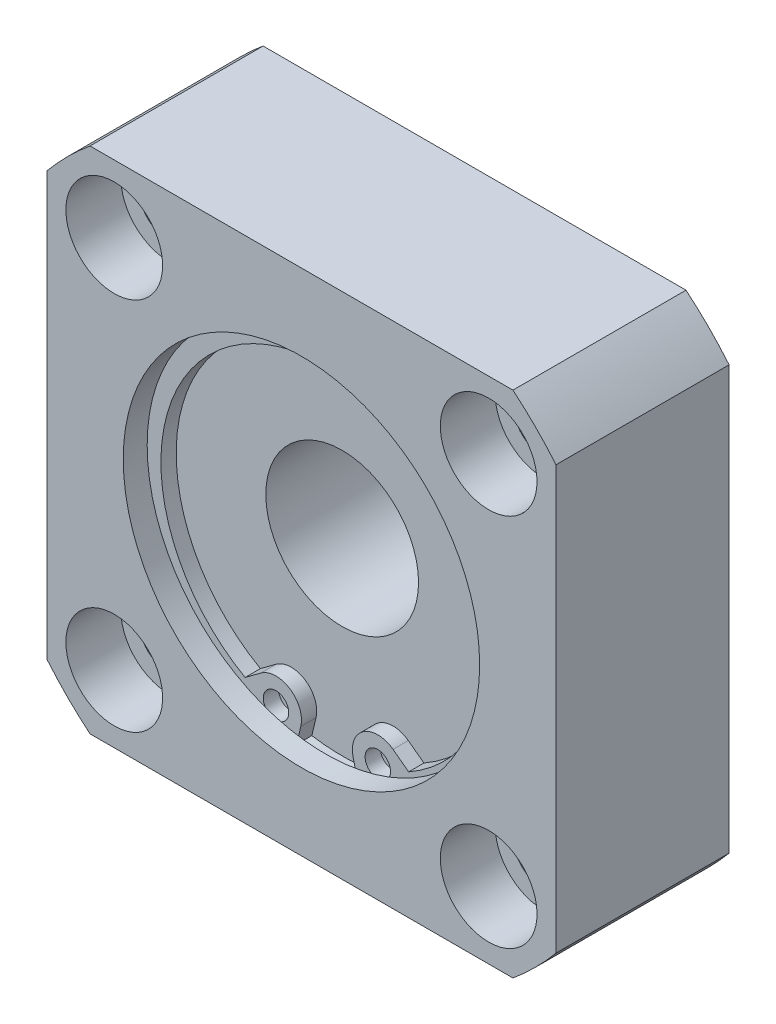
ISO-10303-21;
HEADER;
FILE_DESCRIPTION(('STEP AP214'),'2;1');
FILE_NAME('part.step','',(''),(''),'','','');
FILE_SCHEMA(('AUTOMOTIVE_DESIGN { 1 0 10303 214 1 1 1 1 }'));
ENDSEC;
DATA;
#1=APPLICATION_CONTEXT('core data for automotive mechanical design processes');
#2=APPLICATION_PROTOCOL_DEFINITION('international standard','automotive_design',2000,#1);
#3=PRODUCT_CONTEXT('',#1,'mechanical');
#4=PRODUCT('Part','Part','',(#3));
#5=PRODUCT_RELATED_PRODUCT_CATEGORY('part','',(#4));
#6=PRODUCT_DEFINITION_FORMATION('','',#4);
#7=PRODUCT_DEFINITION_CONTEXT('part definition',#1,'design');
#8=PRODUCT_DEFINITION('design','',#6,#7);
#9=PRODUCT_DEFINITION_SHAPE('','',#8);
#10=(LENGTH_UNIT() NAMED_UNIT(*) SI_UNIT(.MILLI.,.METRE.));
#11=(NAMED_UNIT(*) PLANE_ANGLE_UNIT() SI_UNIT($,.RADIAN.));
#12=(NAMED_UNIT(*) SI_UNIT($,.STERADIAN.) SOLID_ANGLE_UNIT());
#13=UNCERTAINTY_MEASURE_WITH_UNIT(LENGTH_MEASURE(1.E-05),#10,'distance_accuracy_value','');
#14=(GEOMETRIC_REPRESENTATION_CONTEXT(3) GLOBAL_UNCERTAINTY_ASSIGNED_CONTEXT((#13)) GLOBAL_UNIT_ASSIGNED_CONTEXT((#10,
#11,#12)) REPRESENTATION_CONTEXT('',''));
#15=CARTESIAN_POINT('',(0.,0.,0.));
#16=DIRECTION('',(0.,0.,1.));
#17=DIRECTION('',(1.,0.,0.));
#18=AXIS2_PLACEMENT_3D('',#15,#16,#17);
#19=CARTESIAN_POINT('',(18.3847763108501,18.3847763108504,0.));
#20=DIRECTION('',(0.,0.,1.));
#21=DIRECTION('',(1.,0.,0.));
#22=AXIS2_PLACEMENT_3D('',#19,#20,#21);
#23=CYLINDRICAL_SURFACE('',#22,3.);
#24=CARTESIAN_POINT('',(18.3847763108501,18.3847763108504,0.));
#25=DIRECTION('',(0.,0.,1.));
#26=DIRECTION('',(1.,0.,0.));
#27=AXIS2_PLACEMENT_3D('',#24,#25,#26);
#28=CIRCLE('',#27,3.);
#29=CARTESIAN_POINT('',(21.3847763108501,18.3847763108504,0.));
#30=VERTEX_POINT('',#29);
#31=EDGE_CURVE('E272',#30,#30,#28,.T.);
#32=ORIENTED_EDGE('',*,*,#31,.F.);
#33=EDGE_LOOP('',(#32));
#34=FACE_BOUND('',#33,.T.);
#35=CARTESIAN_POINT('',(18.3847763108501,18.3847763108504,11.6));
#36=DIRECTION('',(0.,0.,1.));
#37=DIRECTION('',(1.,0.,0.));
#38=AXIS2_PLACEMENT_3D('',#35,#36,#37);
#39=CIRCLE('',#38,3.);
#40=CARTESIAN_POINT('',(21.3847763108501,18.3847763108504,11.6));
#41=VERTEX_POINT('',#40);
#42=EDGE_CURVE('E269',#41,#41,#39,.F.);
#43=ORIENTED_EDGE('',*,*,#42,.F.);
#44=EDGE_LOOP('',(#43));
#45=FACE_BOUND('',#44,.T.);
#46=ADVANCED_FACE('F14',(#34,#45),#23,.F.);
#47=CARTESIAN_POINT('',(18.3847763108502,-18.3847763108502,0.));
#48=DIRECTION('',(0.,0.,1.));
#49=DIRECTION('',(1.,0.,0.));
#50=AXIS2_PLACEMENT_3D('',#47,#48,#49);
#51=CYLINDRICAL_SURFACE('',#50,3.);
#52=CARTESIAN_POINT('',(18.3847763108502,-18.3847763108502,0.));
#53=DIRECTION('',(0.,0.,1.));
#54=DIRECTION('',(0.,-1.,0.));
#55=AXIS2_PLACEMENT_3D('',#52,#53,#54);
#56=CIRCLE('',#55,3.);
#57=CARTESIAN_POINT('',(18.3847763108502,-21.3847763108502,0.));
#58=VERTEX_POINT('',#57);
#59=EDGE_CURVE('E341',#58,#58,#56,.T.);
#60=ORIENTED_EDGE('',*,*,#59,.F.);
#61=EDGE_LOOP('',(#60));
#62=FACE_BOUND('',#61,.T.);
#63=CARTESIAN_POINT('',(18.3847763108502,-18.3847763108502,11.6));
#64=DIRECTION('',(0.,0.,1.));
#65=DIRECTION('',(1.,0.,0.));
#66=AXIS2_PLACEMENT_3D('',#63,#64,#65);
#67=CIRCLE('',#66,3.);
#68=CARTESIAN_POINT('',(21.3847763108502,-18.3847763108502,11.6));
#69=VERTEX_POINT('',#68);
#70=EDGE_CURVE('E264',#69,#69,#67,.F.);
#71=ORIENTED_EDGE('',*,*,#70,.F.);
#72=EDGE_LOOP('',(#71));
#73=FACE_BOUND('',#72,.T.);
#74=ADVANCED_FACE('F529',(#62,#73),#51,.F.);
#75=CARTESIAN_POINT('',(-18.3847763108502,-18.3847763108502,0.));
#76=DIRECTION('',(0.,0.,1.));
#77=DIRECTION('',(1.,0.,0.));
#78=AXIS2_PLACEMENT_3D('',#75,#76,#77);
#79=CYLINDRICAL_SURFACE('',#78,3.);
#80=CARTESIAN_POINT('',(-18.3847763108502,-18.3847763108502,0.));
#81=DIRECTION('',(0.,0.,1.));
#82=DIRECTION('',(-1.,0.,0.));
#83=AXIS2_PLACEMENT_3D('',#80,#81,#82);
#84=CIRCLE('',#83,3.);
#85=CARTESIAN_POINT('',(-21.3847763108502,-18.3847763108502,0.));
#86=VERTEX_POINT('',#85);
#87=EDGE_CURVE('E344',#86,#86,#84,.T.);
#88=ORIENTED_EDGE('',*,*,#87,.F.);
#89=EDGE_LOOP('',(#88));
#90=FACE_BOUND('',#89,.T.);
#91=CARTESIAN_POINT('',(-18.3847763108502,-18.3847763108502,11.6));
#92=DIRECTION('',(0.,0.,1.));
#93=DIRECTION('',(1.,0.,0.));
#94=AXIS2_PLACEMENT_3D('',#91,#92,#93);
#95=CIRCLE('',#94,3.);
#96=CARTESIAN_POINT('',(-15.3847763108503,-18.3847763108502,11.6));
#97=VERTEX_POINT('',#96);
#98=EDGE_CURVE('E259',#97,#97,#95,.F.);
#99=ORIENTED_EDGE('',*,*,#98,.F.);
#100=EDGE_LOOP('',(#99));
#101=FACE_BOUND('',#100,.T.);
#102=ADVANCED_FACE('F538',(#90,#101),#79,.F.);
#103=CARTESIAN_POINT('',(-18.3847763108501,18.3847763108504,0.));
#104=DIRECTION('',(0.,0.,1.));
#105=DIRECTION('',(1.,0.,0.));
#106=AXIS2_PLACEMENT_3D('',#103,#104,#105);
#107=CYLINDRICAL_SURFACE('',#106,3.);
#108=CARTESIAN_POINT('',(-18.3847763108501,18.3847763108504,0.));
#109=DIRECTION('',(0.,0.,1.));
#110=DIRECTION('',(0.,1.,0.));
#111=AXIS2_PLACEMENT_3D('',#108,#109,#110);
#112=CIRCLE('',#111,3.);
#113=CARTESIAN_POINT('',(-18.3847763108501,21.3847763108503,0.));
#114=VERTEX_POINT('',#113);
#115=EDGE_CURVE('E267',#114,#114,#112,.T.);
#116=ORIENTED_EDGE('',*,*,#115,.F.);
#117=EDGE_LOOP('',(#116));
#118=FACE_BOUND('',#117,.T.);
#119=CARTESIAN_POINT('',(-18.3847763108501,18.3847763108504,11.6));
#120=DIRECTION('',(0.,0.,1.));
#121=DIRECTION('',(1.,0.,0.));
#122=AXIS2_PLACEMENT_3D('',#119,#120,#121);
#123=CIRCLE('',#122,3.);
#124=CARTESIAN_POINT('',(-15.3847763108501,18.3847763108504,11.6));
#125=VERTEX_POINT('',#124);
#126=EDGE_CURVE('E254',#125,#125,#123,.F.);
#127=ORIENTED_EDGE('',*,*,#126,.F.);
#128=EDGE_LOOP('',(#127));
#129=FACE_BOUND('',#128,.T.);
#130=ADVANCED_FACE('F547',(#118,#129),#107,.F.);
#131=CARTESIAN_POINT('',(18.3847763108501,18.3847763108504,11.6));
#132=DIRECTION('',(0.,0.,1.));
#133=DIRECTION('',(1.,0.,0.));
#134=AXIS2_PLACEMENT_3D('',#131,#132,#133);
#135=PLANE('',#134);
#136=CARTESIAN_POINT('',(18.3847763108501,18.3847763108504,11.6));
#137=DIRECTION('',(0.,0.,1.));
#138=DIRECTION('',(1.,0.,0.));
#139=AXIS2_PLACEMENT_3D('',#136,#137,#138);
#140=CIRCLE('',#139,4.75);
#141=CARTESIAN_POINT('',(23.1347763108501,18.3847763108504,11.6));
#142=VERTEX_POINT('',#141);
#143=EDGE_CURVE('E273',#142,#142,#140,.T.);
#144=ORIENTED_EDGE('',*,*,#143,.T.);
#145=EDGE_LOOP('',(#144));
#146=FACE_BOUND('',#145,.T.);
#147=ORIENTED_EDGE('',*,*,#42,.T.);
#148=EDGE_LOOP('',(#147));
#149=FACE_BOUND('',#148,.T.);
#150=ADVANCED_FACE('F556',(#146,#149),#135,.T.);
#151=CARTESIAN_POINT('',(18.3847763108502,-18.3847763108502,11.6));
#152=DIRECTION('',(0.,0.,1.));
#153=DIRECTION('',(0.,-1.,0.));
#154=AXIS2_PLACEMENT_3D('',#151,#152,#153);
#155=PLANE('',#154);
#156=CARTESIAN_POINT('',(18.3847763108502,-18.3847763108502,11.6));
#157=DIRECTION('',(0.,0.,1.));
#158=DIRECTION('',(0.,-1.,0.));
#159=AXIS2_PLACEMENT_3D('',#156,#157,#158);
#160=CIRCLE('',#159,4.75);
#161=CARTESIAN_POINT('',(18.3847763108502,-23.1347763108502,11.6));
#162=VERTEX_POINT('',#161);
#163=EDGE_CURVE('E268',#162,#162,#160,.T.);
#164=ORIENTED_EDGE('',*,*,#163,.T.);
#165=EDGE_LOOP('',(#164));
#166=FACE_BOUND('',#165,.T.);
#167=ORIENTED_EDGE('',*,*,#70,.T.);
#168=EDGE_LOOP('',(#167));
#169=FACE_BOUND('',#168,.T.);
#170=ADVANCED_FACE('F565',(#166,#169),#155,.T.);
#171=CARTESIAN_POINT('',(-18.3847763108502,-18.3847763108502,11.6));
#172=DIRECTION('',(0.,0.,1.));
#173=DIRECTION('',(-1.,0.,0.));
#174=AXIS2_PLACEMENT_3D('',#171,#172,#173);
#175=PLANE('',#174);
#176=CARTESIAN_POINT('',(-18.3847763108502,-18.3847763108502,11.6));
#177=DIRECTION('',(0.,0.,1.));
#178=DIRECTION('',(-1.,0.,0.));
#179=AXIS2_PLACEMENT_3D('',#176,#177,#178);
#180=CIRCLE('',#179,4.75);
#181=CARTESIAN_POINT('',(-23.1347763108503,-18.3847763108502,11.6));
#182=VERTEX_POINT('',#181);
#183=EDGE_CURVE('E263',#182,#182,#180,.T.);
#184=ORIENTED_EDGE('',*,*,#183,.T.);
#185=EDGE_LOOP('',(#184));
#186=FACE_BOUND('',#185,.T.);
#187=ORIENTED_EDGE('',*,*,#98,.T.);
#188=EDGE_LOOP('',(#187));
#189=FACE_BOUND('',#188,.T.);
#190=ADVANCED_FACE('F574',(#186,#189),#175,.T.);
#191=CARTESIAN_POINT('',(-18.3847763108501,18.3847763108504,11.6));
#192=DIRECTION('',(0.,0.,1.));
#193=DIRECTION('',(0.,1.,0.));
#194=AXIS2_PLACEMENT_3D('',#191,#192,#193);
#195=PLANE('',#194);
#196=CARTESIAN_POINT('',(-18.3847763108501,18.3847763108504,11.6));
#197=DIRECTION('',(0.,0.,1.));
#198=DIRECTION('',(0.,1.,0.));
#199=AXIS2_PLACEMENT_3D('',#196,#197,#198);
#200=CIRCLE('',#199,4.75);
#201=CARTESIAN_POINT('',(-18.3847763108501,23.1347763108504,11.6));
#202=VERTEX_POINT('',#201);
#203=EDGE_CURVE('E258',#202,#202,#200,.T.);
#204=ORIENTED_EDGE('',*,*,#203,.T.);
#205=EDGE_LOOP('',(#204));
#206=FACE_BOUND('',#205,.T.);
#207=ORIENTED_EDGE('',*,*,#126,.T.);
#208=EDGE_LOOP('',(#207));
#209=FACE_BOUND('',#208,.T.);
#210=ADVANCED_FACE('F583',(#206,#209),#195,.T.);
#211=CARTESIAN_POINT('',(0.,0.,0.));
#212=DIRECTION('',(0.,0.,-1.));
#213=DIRECTION('',(-1.,0.,0.));
#214=AXIS2_PLACEMENT_3D('',#211,#212,#213);
#215=PLANE('',#214);
#216=CARTESIAN_POINT('',(0.,0.,0.));
#217=DIRECTION('',(0.,0.,-1.));
#218=DIRECTION('',(-1.,0.,0.));
#219=AXIS2_PLACEMENT_3D('',#216,#217,#218);
#220=CIRCLE('',#219,14.5);
#221=CARTESIAN_POINT('',(-14.5,0.,0.));
#222=VERTEX_POINT('',#221);
#223=EDGE_CURVE('E243',#222,#222,#220,.T.);
#224=ORIENTED_EDGE('',*,*,#223,.F.);
#225=EDGE_LOOP('',(#224));
#226=FACE_BOUND('',#225,.T.);
#227=ORIENTED_EDGE('',*,*,#115,.T.);
#228=EDGE_LOOP('',(#227));
#229=FACE_BOUND('',#228,.T.);
#230=ORIENTED_EDGE('',*,*,#87,.T.);
#231=EDGE_LOOP('',(#230));
#232=FACE_BOUND('',#231,.T.);
#233=ORIENTED_EDGE('',*,*,#59,.T.);
#234=EDGE_LOOP('',(#233));
#235=FACE_BOUND('',#234,.T.);
#236=ORIENTED_EDGE('',*,*,#31,.T.);
#237=EDGE_LOOP('',(#236));
#238=FACE_BOUND('',#237,.T.);
#239=CARTESIAN_POINT('',(0.,0.,0.));
#240=DIRECTION('',(0.,0.,-1.));
#241=DIRECTION('',(-1.,0.,0.));
#242=AXIS2_PLACEMENT_3D('',#239,#240,#241);
#243=CIRCLE('',#242,32.5);
#244=CARTESIAN_POINT('',(25.,-20.7665596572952,0.));
#245=VERTEX_POINT('',#244);
#246=CARTESIAN_POINT('',(20.7665596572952,-25.,0.));
#247=VERTEX_POINT('',#246);
#248=EDGE_CURVE('E332',#245,#247,#243,.T.);
#249=ORIENTED_EDGE('',*,*,#248,.T.);
#250=DIRECTION('',(1.,0.,0.));
#251=VECTOR('',#250,1.);
#252=CARTESIAN_POINT('',(-20.7665596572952,-25.,0.));
#253=LINE('',#252,#251);
#254=CARTESIAN_POINT('',(-20.7665596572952,-25.,0.));
#255=VERTEX_POINT('',#254);
#256=EDGE_CURVE('E329',#255,#247,#253,.T.);
#257=ORIENTED_EDGE('',*,*,#256,.F.);
#258=CARTESIAN_POINT('',(0.,0.,0.));
#259=DIRECTION('',(0.,0.,1.));
#260=DIRECTION('',(1.,0.,0.));
#261=AXIS2_PLACEMENT_3D('',#258,#259,#260);
#262=CIRCLE('',#261,32.5);
#263=CARTESIAN_POINT('',(-25.,-20.7665596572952,0.));
#264=VERTEX_POINT('',#263);
#265=EDGE_CURVE('E326',#264,#255,#262,.T.);
#266=ORIENTED_EDGE('',*,*,#265,.F.);
#267=DIRECTION('',(0.,1.,0.));
#268=VECTOR('',#267,1.);
#269=CARTESIAN_POINT('',(-25.,-20.7665596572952,0.));
#270=LINE('',#269,#268);
#271=CARTESIAN_POINT('',(-25.,20.7665596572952,0.));
#272=VERTEX_POINT('',#271);
#273=EDGE_CURVE('E323',#264,#272,#270,.T.);
#274=ORIENTED_EDGE('',*,*,#273,.T.);
#275=CARTESIAN_POINT('',(0.,0.,0.));
#276=DIRECTION('',(0.,0.,-1.));
#277=DIRECTION('',(-1.,0.,0.));
#278=AXIS2_PLACEMENT_3D('',#275,#276,#277);
#279=CIRCLE('',#278,32.5);
#280=CARTESIAN_POINT('',(-20.7665596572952,25.,0.));
#281=VERTEX_POINT('',#280);
#282=EDGE_CURVE('E320',#272,#281,#279,.T.);
#283=ORIENTED_EDGE('',*,*,#282,.T.);
#284=DIRECTION('',(1.,0.,0.));
#285=VECTOR('',#284,1.);
#286=CARTESIAN_POINT('',(-20.7665596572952,25.,0.));
#287=LINE('',#286,#285);
#288=CARTESIAN_POINT('',(20.7665596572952,25.,0.));
#289=VERTEX_POINT('',#288);
#290=EDGE_CURVE('E317',#281,#289,#287,.T.);
#291=ORIENTED_EDGE('',*,*,#290,.T.);
#292=CARTESIAN_POINT('',(0.,0.,0.));
#293=DIRECTION('',(0.,0.,1.));
#294=DIRECTION('',(1.,0.,0.));
#295=AXIS2_PLACEMENT_3D('',#292,#293,#294);
#296=CIRCLE('',#295,32.5);
#297=CARTESIAN_POINT('',(25.,20.7665596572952,0.));
#298=VERTEX_POINT('',#297);
#299=EDGE_CURVE('E314',#298,#289,#296,.T.);
#300=ORIENTED_EDGE('',*,*,#299,.F.);
#301=DIRECTION('',(0.,1.,0.));
#302=VECTOR('',#301,1.);
#303=CARTESIAN_POINT('',(25.,-20.7665596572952,0.));
#304=LINE('',#303,#302);
#305=EDGE_CURVE('E311',#245,#298,#304,.T.);
#306=ORIENTED_EDGE('',*,*,#305,.F.);
#307=EDGE_LOOP('',(#249,#257,#266,#274,#283,#291,#300,#306));
#308=FACE_BOUND('',#307,.T.);
#309=ADVANCED_FACE('F431',(#226,#229,#232,#235,#238,#308),#215,.T.);
#310=CARTESIAN_POINT('',(-20.7665596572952,-25.,17.));
#311=DIRECTION('',(0.,1.,0.));
#312=DIRECTION('',(0.,0.,1.));
#313=AXIS2_PLACEMENT_3D('',#310,#311,#312);
#314=PLANE('',#313);
#315=DIRECTION('',(1.,0.,0.));
#316=VECTOR('',#315,1.);
#317=CARTESIAN_POINT('',(-20.7665596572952,-25.,17.));
#318=LINE('',#317,#316);
#319=CARTESIAN_POINT('',(-20.7665596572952,-25.,17.));
#320=VERTEX_POINT('',#319);
#321=CARTESIAN_POINT('',(20.7665596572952,-25.,17.));
#322=VERTEX_POINT('',#321);
#323=EDGE_CURVE('E306',#320,#322,#318,.T.);
#324=ORIENTED_EDGE('',*,*,#323,.F.);
#325=DIRECTION('',(0.,0.,-1.));
#326=VECTOR('',#325,1.);
#327=CARTESIAN_POINT('',(-20.7665596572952,-25.,17.));
#328=LINE('',#327,#326);
#329=EDGE_CURVE('E285',#320,#255,#328,.T.);
#330=ORIENTED_EDGE('',*,*,#329,.T.);
#331=ORIENTED_EDGE('',*,*,#256,.T.);
#332=DIRECTION('',(0.,0.,-1.));
#333=VECTOR('',#332,1.);
#334=CARTESIAN_POINT('',(20.7665596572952,-25.,17.));
#335=LINE('',#334,#333);
#336=EDGE_CURVE('E74',#322,#247,#335,.T.);
#337=ORIENTED_EDGE('',*,*,#336,.F.);
#338=EDGE_LOOP('',(#324,#330,#331,#337));
#339=FACE_BOUND('',#338,.T.);
#340=ADVANCED_FACE('F429',(#339),#314,.F.);
#341=CARTESIAN_POINT('',(0.,0.,17.));
#342=DIRECTION('',(0.,0.,-1.));
#343=DIRECTION('',(-1.,0.,0.));
#344=AXIS2_PLACEMENT_3D('',#341,#342,#343);
#345=CYLINDRICAL_SURFACE('',#344,32.5);
#346=ORIENTED_EDGE('',*,*,#329,.F.);
#347=CARTESIAN_POINT('',(0.,0.,17.));
#348=DIRECTION('',(0.,0.,1.));
#349=DIRECTION('',(1.,0.,0.));
#350=AXIS2_PLACEMENT_3D('',#347,#348,#349);
#351=CIRCLE('',#350,32.5);
#352=CARTESIAN_POINT('',(-25.,-20.7665596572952,17.));
#353=VERTEX_POINT('',#352);
#354=EDGE_CURVE('E303',#353,#320,#351,.T.);
#355=ORIENTED_EDGE('',*,*,#354,.F.);
#356=DIRECTION('',(0.,0.,-1.));
#357=VECTOR('',#356,1.);
#358=CARTESIAN_POINT('',(-25.,-20.7665596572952,17.));
#359=LINE('',#358,#357);
#360=EDGE_CURVE('E283',#353,#264,#359,.T.);
#361=ORIENTED_EDGE('',*,*,#360,.T.);
#362=ORIENTED_EDGE('',*,*,#265,.T.);
#363=EDGE_LOOP('',(#346,#355,#361,#362));
#364=FACE_BOUND('',#363,.T.);
#365=ADVANCED_FACE('F425',(#364),#345,.T.);
#366=CARTESIAN_POINT('',(-25.,-20.7665596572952,17.));
#367=DIRECTION('',(-1.,0.,0.));
#368=DIRECTION('',(0.,0.,1.));
#369=AXIS2_PLACEMENT_3D('',#366,#367,#368);
#370=PLANE('',#369);
#371=ORIENTED_EDGE('',*,*,#360,.F.);
#372=DIRECTION('',(0.,1.,0.));
#373=VECTOR('',#372,1.);
#374=CARTESIAN_POINT('',(-25.,-20.7665596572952,17.));
#375=LINE('',#374,#373);
#376=CARTESIAN_POINT('',(-25.,20.7665596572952,17.));
#377=VERTEX_POINT('',#376);
#378=EDGE_CURVE('E300',#353,#377,#375,.T.);
#379=ORIENTED_EDGE('',*,*,#378,.T.);
#380=DIRECTION('',(0.,0.,-1.));
#381=VECTOR('',#380,1.);
#382=CARTESIAN_POINT('',(-25.,20.7665596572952,17.));
#383=LINE('',#382,#381);
#384=EDGE_CURVE('E281',#377,#272,#383,.T.);
#385=ORIENTED_EDGE('',*,*,#384,.T.);
#386=ORIENTED_EDGE('',*,*,#273,.F.);
#387=EDGE_LOOP('',(#371,#379,#385,#386));
#388=FACE_BOUND('',#387,.T.);
#389=ADVANCED_FACE('F422',(#388),#370,.T.);
#390=CARTESIAN_POINT('',(0.,0.,17.));
#391=DIRECTION('',(0.,0.,-1.));
#392=DIRECTION('',(-1.,0.,0.));
#393=AXIS2_PLACEMENT_3D('',#390,#391,#392);
#394=CYLINDRICAL_SURFACE('',#393,32.5);
#395=ORIENTED_EDGE('',*,*,#384,.F.);
#396=CARTESIAN_POINT('',(0.,0.,17.));
#397=DIRECTION('',(0.,0.,-1.));
#398=DIRECTION('',(-1.,0.,0.));
#399=AXIS2_PLACEMENT_3D('',#396,#397,#398);
#400=CIRCLE('',#399,32.5);
#401=CARTESIAN_POINT('',(-20.7665596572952,25.,17.));
#402=VERTEX_POINT('',#401);
#403=EDGE_CURVE('E297',#377,#402,#400,.T.);
#404=ORIENTED_EDGE('',*,*,#403,.T.);
#405=DIRECTION('',(0.,0.,-1.));
#406=VECTOR('',#405,1.);
#407=CARTESIAN_POINT('',(-20.7665596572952,25.,17.));
#408=LINE('',#407,#406);
#409=EDGE_CURVE('E279',#402,#281,#408,.T.);
#410=ORIENTED_EDGE('',*,*,#409,.T.);
#411=ORIENTED_EDGE('',*,*,#282,.F.);
#412=EDGE_LOOP('',(#395,#404,#410,#411));
#413=FACE_BOUND('',#412,.T.);
#414=ADVANCED_FACE('F419',(#413),#394,.T.);
#415=CARTESIAN_POINT('',(-20.7665596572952,25.,17.));
#416=DIRECTION('',(0.,1.,0.));
#417=DIRECTION('',(0.,0.,1.));
#418=AXIS2_PLACEMENT_3D('',#415,#416,#417);
#419=PLANE('',#418);
#420=ORIENTED_EDGE('',*,*,#409,.F.);
#421=DIRECTION('',(1.,0.,0.));
#422=VECTOR('',#421,1.);
#423=CARTESIAN_POINT('',(-20.7665596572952,25.,17.));
#424=LINE('',#423,#422);
#425=CARTESIAN_POINT('',(20.7665596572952,25.,17.));
#426=VERTEX_POINT('',#425);
#427=EDGE_CURVE('E294',#402,#426,#424,.T.);
#428=ORIENTED_EDGE('',*,*,#427,.T.);
#429=DIRECTION('',(0.,0.,-1.));
#430=VECTOR('',#429,1.);
#431=CARTESIAN_POINT('',(20.7665596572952,25.,17.));
#432=LINE('',#431,#430);
#433=EDGE_CURVE('E277',#426,#289,#432,.T.);
#434=ORIENTED_EDGE('',*,*,#433,.T.);
#435=ORIENTED_EDGE('',*,*,#290,.F.);
#436=EDGE_LOOP('',(#420,#428,#434,#435));
#437=FACE_BOUND('',#436,.T.);
#438=ADVANCED_FACE('F415',(#437),#419,.T.);
#439=CARTESIAN_POINT('',(0.,0.,17.));
#440=DIRECTION('',(0.,0.,-1.));
#441=DIRECTION('',(-1.,0.,0.));
#442=AXIS2_PLACEMENT_3D('',#439,#440,#441);
#443=CYLINDRICAL_SURFACE('',#442,32.5);
#444=ORIENTED_EDGE('',*,*,#433,.F.);
#445=CARTESIAN_POINT('',(0.,0.,17.));
#446=DIRECTION('',(0.,0.,1.));
#447=DIRECTION('',(1.,0.,0.));
#448=AXIS2_PLACEMENT_3D('',#445,#446,#447);
#449=CIRCLE('',#448,32.5);
#450=CARTESIAN_POINT('',(25.,20.7665596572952,17.));
#451=VERTEX_POINT('',#450);
#452=EDGE_CURVE('E291',#451,#426,#449,.T.);
#453=ORIENTED_EDGE('',*,*,#452,.F.);
#454=DIRECTION('',(0.,0.,-1.));
#455=VECTOR('',#454,1.);
#456=CARTESIAN_POINT('',(25.,20.7665596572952,17.));
#457=LINE('',#456,#455);
#458=EDGE_CURVE('E275',#451,#298,#457,.T.);
#459=ORIENTED_EDGE('',*,*,#458,.T.);
#460=ORIENTED_EDGE('',*,*,#299,.T.);
#461=EDGE_LOOP('',(#444,#453,#459,#460));
#462=FACE_BOUND('',#461,.T.);
#463=ADVANCED_FACE('F410',(#462),#443,.T.);
#464=CARTESIAN_POINT('',(25.,-20.7665596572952,17.));
#465=DIRECTION('',(-1.,0.,0.));
#466=DIRECTION('',(0.,0.,1.));
#467=AXIS2_PLACEMENT_3D('',#464,#465,#466);
#468=PLANE('',#467);
#469=ORIENTED_EDGE('',*,*,#458,.F.);
#470=DIRECTION('',(0.,1.,0.));
#471=VECTOR('',#470,1.);
#472=CARTESIAN_POINT('',(25.,-20.7665596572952,17.));
#473=LINE('',#472,#471);
#474=CARTESIAN_POINT('',(25.,-20.7665596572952,17.));
#475=VERTEX_POINT('',#474);
#476=EDGE_CURVE('E288',#475,#451,#473,.T.);
#477=ORIENTED_EDGE('',*,*,#476,.F.);
#478=DIRECTION('',(0.,0.,-1.));
#479=VECTOR('',#478,1.);
#480=CARTESIAN_POINT('',(25.,-20.7665596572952,17.));
#481=LINE('',#480,#479);
#482=EDGE_CURVE('E239',#475,#245,#481,.T.);
#483=ORIENTED_EDGE('',*,*,#482,.T.);
#484=ORIENTED_EDGE('',*,*,#305,.T.);
#485=EDGE_LOOP('',(#469,#477,#483,#484));
#486=FACE_BOUND('',#485,.T.);
#487=ADVANCED_FACE('F405',(#486),#468,.F.);
#488=CARTESIAN_POINT('',(0.,0.,17.));
#489=DIRECTION('',(0.,0.,-1.));
#490=DIRECTION('',(-1.,0.,0.));
#491=AXIS2_PLACEMENT_3D('',#488,#489,#490);
#492=CYLINDRICAL_SURFACE('',#491,32.5);
#493=ORIENTED_EDGE('',*,*,#482,.F.);
#494=CARTESIAN_POINT('',(0.,0.,17.));
#495=DIRECTION('',(0.,0.,-1.));
#496=DIRECTION('',(-1.,0.,0.));
#497=AXIS2_PLACEMENT_3D('',#494,#495,#496);
#498=CIRCLE('',#497,32.5);
#499=EDGE_CURVE('E309',#475,#322,#498,.T.);
#500=ORIENTED_EDGE('',*,*,#499,.T.);
#501=ORIENTED_EDGE('',*,*,#336,.T.);
#502=ORIENTED_EDGE('',*,*,#248,.F.);
#503=EDGE_LOOP('',(#493,#500,#501,#502));
#504=FACE_BOUND('',#503,.T.);
#505=ADVANCED_FACE('F432',(#504),#492,.T.);
#506=CARTESIAN_POINT('',(18.3847763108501,18.3847763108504,11.6));
#507=DIRECTION('',(0.,0.,1.));
#508=DIRECTION('',(1.,0.,0.));
#509=AXIS2_PLACEMENT_3D('',#506,#507,#508);
#510=CYLINDRICAL_SURFACE('',#509,4.75);
#511=ORIENTED_EDGE('',*,*,#143,.F.);
#512=EDGE_LOOP('',(#511));
#513=FACE_BOUND('',#512,.T.);
#514=CARTESIAN_POINT('',(18.3847763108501,18.3847763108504,17.));
#515=DIRECTION('',(0.,0.,1.));
#516=DIRECTION('',(1.,0.,0.));
#517=AXIS2_PLACEMENT_3D('',#514,#515,#516);
#518=CIRCLE('',#517,4.75);
#519=CARTESIAN_POINT('',(23.1347763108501,18.3847763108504,17.));
#520=VERTEX_POINT('',#519);
#521=EDGE_CURVE('E338',#520,#520,#518,.T.);
#522=ORIENTED_EDGE('',*,*,#521,.T.);
#523=EDGE_LOOP('',(#522));
#524=FACE_BOUND('',#523,.T.);
#525=ADVANCED_FACE('F434',(#513,#524),#510,.F.);
#526=CARTESIAN_POINT('',(18.3847763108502,-18.3847763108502,11.6));
#527=DIRECTION('',(0.,0.,1.));
#528=DIRECTION('',(1.,0.,0.));
#529=AXIS2_PLACEMENT_3D('',#526,#527,#528);
#530=CYLINDRICAL_SURFACE('',#529,4.75);
#531=ORIENTED_EDGE('',*,*,#163,.F.);
#532=EDGE_LOOP('',(#531));
#533=FACE_BOUND('',#532,.T.);
#534=CARTESIAN_POINT('',(18.3847763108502,-18.3847763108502,17.));
#535=DIRECTION('',(0.,0.,1.));
#536=DIRECTION('',(0.,-1.,0.));
#537=AXIS2_PLACEMENT_3D('',#534,#535,#536);
#538=CIRCLE('',#537,4.75);
#539=CARTESIAN_POINT('',(18.3847763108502,-23.1347763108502,17.));
#540=VERTEX_POINT('',#539);
#541=EDGE_CURVE('E262',#540,#540,#538,.T.);
#542=ORIENTED_EDGE('',*,*,#541,.T.);
#543=EDGE_LOOP('',(#542));
#544=FACE_BOUND('',#543,.T.);
#545=ADVANCED_FACE('F441',(#533,#544),#530,.F.);
#546=CARTESIAN_POINT('',(-18.3847763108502,-18.3847763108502,11.6));
#547=DIRECTION('',(0.,0.,1.));
#548=DIRECTION('',(1.,0.,0.));
#549=AXIS2_PLACEMENT_3D('',#546,#547,#548);
#550=CYLINDRICAL_SURFACE('',#549,4.75);
#551=ORIENTED_EDGE('',*,*,#183,.F.);
#552=EDGE_LOOP('',(#551));
#553=FACE_BOUND('',#552,.T.);
#554=CARTESIAN_POINT('',(-18.3847763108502,-18.3847763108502,17.));
#555=DIRECTION('',(0.,0.,1.));
#556=DIRECTION('',(-1.,0.,0.));
#557=AXIS2_PLACEMENT_3D('',#554,#555,#556);
#558=CIRCLE('',#557,4.75);
#559=CARTESIAN_POINT('',(-23.1347763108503,-18.3847763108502,17.));
#560=VERTEX_POINT('',#559);
#561=EDGE_CURVE('E257',#560,#560,#558,.T.);
#562=ORIENTED_EDGE('',*,*,#561,.T.);
#563=EDGE_LOOP('',(#562));
#564=FACE_BOUND('',#563,.T.);
#565=ADVANCED_FACE('F650',(#553,#564),#550,.F.);
#566=CARTESIAN_POINT('',(-18.3847763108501,18.3847763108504,11.6));
#567=DIRECTION('',(0.,0.,1.));
#568=DIRECTION('',(1.,0.,0.));
#569=AXIS2_PLACEMENT_3D('',#566,#567,#568);
#570=CYLINDRICAL_SURFACE('',#569,4.75);
#571=ORIENTED_EDGE('',*,*,#203,.F.);
#572=EDGE_LOOP('',(#571));
#573=FACE_BOUND('',#572,.T.);
#574=CARTESIAN_POINT('',(-18.3847763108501,18.3847763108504,17.));
#575=DIRECTION('',(0.,0.,1.));
#576=DIRECTION('',(0.,1.,0.));
#577=AXIS2_PLACEMENT_3D('',#574,#575,#576);
#578=CIRCLE('',#577,4.75);
#579=CARTESIAN_POINT('',(-18.3847763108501,23.1347763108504,17.));
#580=VERTEX_POINT('',#579);
#581=EDGE_CURVE('E253',#580,#580,#578,.T.);
#582=ORIENTED_EDGE('',*,*,#581,.T.);
#583=EDGE_LOOP('',(#582));
#584=FACE_BOUND('',#583,.T.);
#585=ADVANCED_FACE('F660',(#573,#584),#570,.F.);
#586=CARTESIAN_POINT('',(0.,0.,2.));
#587=DIRECTION('',(0.,0.,-1.));
#588=DIRECTION('',(-1.,0.,0.));
#589=AXIS2_PLACEMENT_3D('',#586,#587,#588);
#590=CYLINDRICAL_SURFACE('',#589,14.5);
#591=CARTESIAN_POINT('',(0.,0.,2.));
#592=DIRECTION('',(0.,0.,-1.));
#593=DIRECTION('',(-1.,0.,0.));
#594=AXIS2_PLACEMENT_3D('',#591,#592,#593);
#595=CIRCLE('',#594,14.5);
#596=CARTESIAN_POINT('',(-14.5,0.,2.));
#597=VERTEX_POINT('',#596);
#598=EDGE_CURVE('E249',#597,#597,#595,.T.);
#599=ORIENTED_EDGE('',*,*,#598,.F.);
#600=EDGE_LOOP('',(#599));
#601=FACE_BOUND('',#600,.T.);
#602=ORIENTED_EDGE('',*,*,#223,.T.);
#603=EDGE_LOOP('',(#602));
#604=FACE_BOUND('',#603,.T.);
#605=ADVANCED_FACE('F391',(#601,#604),#590,.F.);
#606=CARTESIAN_POINT('',(0.,0.,17.));
#607=DIRECTION('',(0.,0.,-1.));
#608=DIRECTION('',(-1.,0.,0.));
#609=AXIS2_PLACEMENT_3D('',#606,#607,#608);
#610=PLANE('',#609);
#611=CARTESIAN_POINT('',(0.,0.,17.));
#612=DIRECTION('',(0.,0.,1.));
#613=DIRECTION('',(1.,0.,0.));
#614=AXIS2_PLACEMENT_3D('',#611,#612,#613);
#615=CIRCLE('',#614,17.5);
#616=CARTESIAN_POINT('',(17.5,0.,17.));
#617=VERTEX_POINT('',#616);
#618=EDGE_CURVE('E248',#617,#617,#615,.T.);
#619=ORIENTED_EDGE('',*,*,#618,.F.);
#620=EDGE_LOOP('',(#619));
#621=FACE_BOUND('',#620,.T.);
#622=ORIENTED_EDGE('',*,*,#581,.F.);
#623=EDGE_LOOP('',(#622));
#624=FACE_BOUND('',#623,.T.);
#625=ORIENTED_EDGE('',*,*,#561,.F.);
#626=EDGE_LOOP('',(#625));
#627=FACE_BOUND('',#626,.T.);
#628=ORIENTED_EDGE('',*,*,#541,.F.);
#629=EDGE_LOOP('',(#628));
#630=FACE_BOUND('',#629,.T.);
#631=ORIENTED_EDGE('',*,*,#521,.F.);
#632=EDGE_LOOP('',(#631));
#633=FACE_BOUND('',#632,.T.);
#634=ORIENTED_EDGE('',*,*,#499,.F.);
#635=ORIENTED_EDGE('',*,*,#476,.T.);
#636=ORIENTED_EDGE('',*,*,#452,.T.);
#637=ORIENTED_EDGE('',*,*,#427,.F.);
#638=ORIENTED_EDGE('',*,*,#403,.F.);
#639=ORIENTED_EDGE('',*,*,#378,.F.);
#640=ORIENTED_EDGE('',*,*,#354,.T.);
#641=ORIENTED_EDGE('',*,*,#323,.T.);
#642=EDGE_LOOP('',(#634,#635,#636,#637,#638,#639,#640,#641));
#643=FACE_BOUND('',#642,.T.);
#644=ADVANCED_FACE('F388',(#621,#624,#627,#630,#633,#643),#610,.F.);
#645=CARTESIAN_POINT('',(0.,0.,2.));
#646=DIRECTION('',(0.,0.,-1.));
#647=DIRECTION('',(-1.,0.,0.));
#648=AXIS2_PLACEMENT_3D('',#645,#646,#647);
#649=PLANE('',#648);
#650=CARTESIAN_POINT('',(0.,0.,2.));
#651=DIRECTION('',(0.,0.,-1.));
#652=DIRECTION('',(-1.,0.,0.));
#653=AXIS2_PLACEMENT_3D('',#650,#651,#652);
#654=CIRCLE('',#653,7.5);
#655=CARTESIAN_POINT('',(-7.5,0.,2.));
#656=VERTEX_POINT('',#655);
#657=EDGE_CURVE('E245',#656,#656,#654,.T.);
#658=ORIENTED_EDGE('',*,*,#657,.F.);
#659=EDGE_LOOP('',(#658));
#660=FACE_BOUND('',#659,.T.);
#661=ORIENTED_EDGE('',*,*,#598,.T.);
#662=EDGE_LOOP('',(#661));
#663=FACE_BOUND('',#662,.T.);
#664=ADVANCED_FACE('F384',(#660,#663),#649,.T.);
#665=CARTESIAN_POINT('',(0.,0.,13.));
#666=DIRECTION('',(0.,0.,1.));
#667=DIRECTION('',(1.,0.,0.));
#668=AXIS2_PLACEMENT_3D('',#665,#666,#667);
#669=CYLINDRICAL_SURFACE('',#668,17.5);
#670=CARTESIAN_POINT('',(0.,0.,14.65));
#671=DIRECTION('',(0.,0.,1.));
#672=DIRECTION('',(1.,0.,0.));
#673=AXIS2_PLACEMENT_3D('',#670,#671,#672);
#674=CIRCLE('',#673,17.5);
#675=CARTESIAN_POINT('',(17.5,0.,14.65));
#676=VERTEX_POINT('',#675);
#677=EDGE_CURVE('E240',#676,#676,#674,.F.);
#678=ORIENTED_EDGE('',*,*,#677,.T.);
#679=EDGE_LOOP('',(#678));
#680=FACE_BOUND('',#679,.T.);
#681=ORIENTED_EDGE('',*,*,#618,.T.);
#682=EDGE_LOOP('',(#681));
#683=FACE_BOUND('',#682,.T.);
#684=ADVANCED_FACE('F380',(#680,#683),#669,.F.);
#685=CARTESIAN_POINT('',(0.,0.,17.));
#686=DIRECTION('',(0.,0.,-1.));
#687=DIRECTION('',(-1.,0.,0.));
#688=AXIS2_PLACEMENT_3D('',#685,#686,#687);
#689=CYLINDRICAL_SURFACE('',#688,7.5);
#690=CARTESIAN_POINT('',(0.,0.,13.));
#691=DIRECTION('',(0.,0.,1.));
#692=DIRECTION('',(1.,0.,0.));
#693=AXIS2_PLACEMENT_3D('',#690,#691,#692);
#694=CIRCLE('',#693,7.5);
#695=CARTESIAN_POINT('',(7.5,0.,13.));
#696=VERTEX_POINT('',#695);
#697=EDGE_CURVE('E250',#696,#696,#694,.T.);
#698=ORIENTED_EDGE('',*,*,#697,.T.);
#699=EDGE_LOOP('',(#698));
#700=FACE_BOUND('',#699,.T.);
#701=ORIENTED_EDGE('',*,*,#657,.T.);
#702=EDGE_LOOP('',(#701));
#703=FACE_BOUND('',#702,.T.);
#704=ADVANCED_FACE('F383',(#700,#703),#689,.F.);
#705=CARTESIAN_POINT('',(0.,0.,13.));
#706=DIRECTION('',(0.,0.,1.));
#707=DIRECTION('',(1.,0.,0.));
#708=AXIS2_PLACEMENT_3D('',#705,#706,#707);
#709=PLANE('',#708);
#710=ORIENTED_EDGE('',*,*,#697,.F.);
#711=EDGE_LOOP('',(#710));
#712=FACE_BOUND('',#711,.T.);
#713=CARTESIAN_POINT('',(0.,0.,13.));
#714=DIRECTION('',(0.,0.,1.));
#715=DIRECTION('',(1.,0.,0.));
#716=AXIS2_PLACEMENT_3D('',#713,#714,#715);
#717=CIRCLE('',#716,18.5);
#718=CARTESIAN_POINT('',(-2.97957431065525,-18.2584812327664,13.));
#719=VERTEX_POINT('',#718);
#720=CARTESIAN_POINT('',(2.97957431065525,-18.2584812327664,13.));
#721=VERTEX_POINT('',#720);
#722=EDGE_CURVE('E189',#719,#721,#717,.T.);
#723=ORIENTED_EDGE('',*,*,#722,.T.);
#724=DIRECTION('',(-0.231349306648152,0.972870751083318,0.));
#725=VECTOR('',#724,1.);
#726=CARTESIAN_POINT('',(-1.28939062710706,-0.306617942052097,13.));
#727=LINE('',#726,#725);
#728=CARTESIAN_POINT('',(2.56782312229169,-16.526983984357,13.));
#729=VERTEX_POINT('',#728);
#730=EDGE_CURVE('E9',#721,#729,#727,.T.);
#731=ORIENTED_EDGE('',*,*,#730,.T.);
#732=CARTESIAN_POINT('',(5.,-15.9486107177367,13.));
#733=DIRECTION('',(0.,0.,1.));
#734=DIRECTION('',(1.,0.,0.));
#735=AXIS2_PLACEMENT_3D('',#732,#733,#734);
#736=CIRCLE('',#735,2.5);
#737=CARTESIAN_POINT('',(6.49138441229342,-13.9421779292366,13.));
#738=VERTEX_POINT('',#737);
#739=EDGE_CURVE('E25',#738,#729,#736,.T.);
#740=ORIENTED_EDGE('',*,*,#739,.F.);
#741=DIRECTION('',(0.802573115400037,-0.596553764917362,0.));
#742=VECTOR('',#741,1.);
#743=CARTESIAN_POINT('',(-4.36507777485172,-5.87255378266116,13.));
#744=LINE('',#743,#742);
#745=CARTESIAN_POINT('',(8.02922574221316,-15.0852576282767,13.));
#746=VERTEX_POINT('',#745);
#747=EDGE_CURVE('E150',#738,#746,#744,.T.);
#748=ORIENTED_EDGE('',*,*,#747,.T.);
#749=CARTESIAN_POINT('',(0.,-0.9,13.));
#750=DIRECTION('',(0.,0.,1.));
#751=DIRECTION('',(1.,0.,0.));
#752=AXIS2_PLACEMENT_3D('',#749,#750,#751);
#753=CIRCLE('',#752,16.3);
#754=CARTESIAN_POINT('',(-8.02922574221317,-15.0852576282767,13.));
#755=VERTEX_POINT('',#754);
#756=EDGE_CURVE('E154',#746,#755,#753,.T.);
#757=ORIENTED_EDGE('',*,*,#756,.T.);
#758=DIRECTION('',(0.802573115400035,0.596553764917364,0.));
#759=VECTOR('',#758,1.);
#760=CARTESIAN_POINT('',(4.36507777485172,-5.87255378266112,13.));
#761=LINE('',#760,#759);
#762=CARTESIAN_POINT('',(-6.49138441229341,-13.9421779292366,13.));
#763=VERTEX_POINT('',#762);
#764=EDGE_CURVE('E169',#755,#763,#761,.T.);
#765=ORIENTED_EDGE('',*,*,#764,.T.);
#766=CARTESIAN_POINT('',(-5.,-15.9486107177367,13.));
#767=DIRECTION('',(0.,0.,1.));
#768=DIRECTION('',(1.,0.,0.));
#769=AXIS2_PLACEMENT_3D('',#766,#767,#768);
#770=CIRCLE('',#769,2.5);
#771=CARTESIAN_POINT('',(-2.5678231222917,-16.526983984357,13.));
#772=VERTEX_POINT('',#771);
#773=EDGE_CURVE('E222',#772,#763,#770,.T.);
#774=ORIENTED_EDGE('',*,*,#773,.F.);
#775=DIRECTION('',(-0.231349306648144,-0.97287075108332,0.));
#776=VECTOR('',#775,1.);
#777=CARTESIAN_POINT('',(1.28939062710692,-0.306617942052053,13.));
#778=LINE('',#777,#776);
#779=EDGE_CURVE('E220',#772,#719,#778,.T.);
#780=ORIENTED_EDGE('',*,*,#779,.T.);
#781=EDGE_LOOP('',(#723,#731,#740,#748,#757,#765,#774,#780));
#782=FACE_BOUND('',#781,.T.);
#783=ADVANCED_FACE('F153',(#712,#782),#709,.T.);
#784=CARTESIAN_POINT('',(0.,0.,14.65));
#785=DIRECTION('',(0.,0.,1.));
#786=DIRECTION('',(1.,0.,0.));
#787=AXIS2_PLACEMENT_3D('',#784,#785,#786);
#788=PLANE('',#787);
#789=CARTESIAN_POINT('',(0.,0.,14.65));
#790=DIRECTION('',(0.,0.,1.));
#791=DIRECTION('',(1.,0.,0.));
#792=AXIS2_PLACEMENT_3D('',#789,#790,#791);
#793=CIRCLE('',#792,18.5);
#794=CARTESIAN_POINT('',(18.5,0.,14.65));
#795=VERTEX_POINT('',#794);
#796=EDGE_CURVE('E244',#795,#795,#793,.T.);
#797=ORIENTED_EDGE('',*,*,#796,.F.);
#798=EDGE_LOOP('',(#797));
#799=FACE_BOUND('',#798,.T.);
#800=ORIENTED_EDGE('',*,*,#677,.F.);
#801=EDGE_LOOP('',(#800));
#802=FACE_BOUND('',#801,.T.);
#803=ADVANCED_FACE('F374',(#799,#802),#788,.F.);
#804=CARTESIAN_POINT('',(0.,0.,14.65));
#805=DIRECTION('',(0.,0.,-1.));
#806=DIRECTION('',(-1.,0.,0.));
#807=AXIS2_PLACEMENT_3D('',#804,#805,#806);
#808=CYLINDRICAL_SURFACE('',#807,18.5);
#809=ORIENTED_EDGE('',*,*,#796,.T.);
#810=EDGE_LOOP('',(#809));
#811=FACE_BOUND('',#810,.T.);
#812=CARTESIAN_POINT('',(0.,0.,14.5));
#813=DIRECTION('',(0.,0.,1.));
#814=DIRECTION('',(1.,0.,0.));
#815=AXIS2_PLACEMENT_3D('',#812,#813,#814);
#816=CIRCLE('',#815,18.5);
#817=CARTESIAN_POINT('',(2.97957431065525,-18.2584812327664,14.5));
#818=VERTEX_POINT('',#817);
#819=CARTESIAN_POINT('',(-2.97957431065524,-18.2584812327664,14.5));
#820=VERTEX_POINT('',#819);
#821=EDGE_CURVE('E237',#818,#820,#816,.T.);
#822=ORIENTED_EDGE('',*,*,#821,.F.);
#823=DIRECTION('',(0.,0.,-1.));
#824=VECTOR('',#823,1.);
#825=CARTESIAN_POINT('',(2.97957431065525,-18.2584812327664,14.65));
#826=LINE('',#825,#824);
#827=EDGE_CURVE('E232',#818,#721,#826,.T.);
#828=ORIENTED_EDGE('',*,*,#827,.T.);
#829=ORIENTED_EDGE('',*,*,#722,.F.);
#830=DIRECTION('',(0.,0.,-1.));
#831=VECTOR('',#830,1.);
#832=CARTESIAN_POINT('',(-2.97957431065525,-18.2584812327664,14.65));
#833=LINE('',#832,#831);
#834=EDGE_CURVE('E235',#719,#820,#833,.F.);
#835=ORIENTED_EDGE('',*,*,#834,.T.);
#836=EDGE_LOOP('',(#822,#828,#829,#835));
#837=FACE_BOUND('',#836,.T.);
#838=ADVANCED_FACE('F371',(#811,#837),#808,.F.);
#839=CARTESIAN_POINT('',(5.,-15.9486107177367,13.));
#840=DIRECTION('',(0.,0.,1.));
#841=DIRECTION('',(1.,0.,0.));
#842=AXIS2_PLACEMENT_3D('',#839,#840,#841);
#843=CIRCLE('',#842,1.25);
#844=CARTESIAN_POINT('',(6.25,-15.9486107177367,13.));
#845=VERTEX_POINT('',#844);
#846=EDGE_CURVE('E229',#845,#845,#843,.T.);
#847=ORIENTED_EDGE('',*,*,#846,.T.);
#848=EDGE_LOOP('',(#847));
#849=FACE_BOUND('',#848,.T.);
#850=ADVANCED_FACE('F455',(#849),#709,.T.);
#851=CARTESIAN_POINT('',(-5.,-15.9486107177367,13.));
#852=DIRECTION('',(0.,0.,1.));
#853=DIRECTION('',(1.,0.,0.));
#854=AXIS2_PLACEMENT_3D('',#851,#852,#853);
#855=CIRCLE('',#854,1.25);
#856=CARTESIAN_POINT('',(-3.75,-15.9486107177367,13.));
#857=VERTEX_POINT('',#856);
#858=EDGE_CURVE('E225',#857,#857,#855,.T.);
#859=ORIENTED_EDGE('',*,*,#858,.T.);
#860=EDGE_LOOP('',(#859));
#861=FACE_BOUND('',#860,.T.);
#862=ADVANCED_FACE('F448',(#861),#709,.T.);
#863=CARTESIAN_POINT('',(5.,-15.9486107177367,14.6));
#864=DIRECTION('',(0.,0.,1.));
#865=DIRECTION('',(-1.,0.,0.));
#866=AXIS2_PLACEMENT_3D('',#863,#864,#865);
#867=CYLINDRICAL_SURFACE('',#866,2.5);
#868=DIRECTION('',(0.,0.,-1.));
#869=VECTOR('',#868,1.);
#870=CARTESIAN_POINT('',(2.5678231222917,-16.526983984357,14.6));
#871=LINE('',#870,#869);
#872=CARTESIAN_POINT('',(2.56782312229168,-16.526983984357,14.5));
#873=VERTEX_POINT('',#872);
#874=EDGE_CURVE('E182',#873,#729,#871,.T.);
#875=ORIENTED_EDGE('',*,*,#874,.F.);
#876=CARTESIAN_POINT('',(5.,-15.9486107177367,14.5));
#877=DIRECTION('',(0.,0.,1.));
#878=DIRECTION('',(1.,0.,0.));
#879=AXIS2_PLACEMENT_3D('',#876,#877,#878);
#880=CIRCLE('',#879,2.5);
#881=CARTESIAN_POINT('',(6.49138441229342,-13.9421779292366,14.5));
#882=VERTEX_POINT('',#881);
#883=EDGE_CURVE('E59',#882,#873,#880,.T.);
#884=ORIENTED_EDGE('',*,*,#883,.F.);
#885=DIRECTION('',(0.,0.,-1.));
#886=VECTOR('',#885,1.);
#887=CARTESIAN_POINT('',(6.49138441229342,-13.9421779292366,14.6));
#888=LINE('',#887,#886);
#889=EDGE_CURVE('E175',#882,#738,#888,.T.);
#890=ORIENTED_EDGE('',*,*,#889,.T.);
#891=ORIENTED_EDGE('',*,*,#739,.T.);
#892=EDGE_LOOP('',(#875,#884,#890,#891));
#893=FACE_BOUND('',#892,.T.);
#894=ADVANCED_FACE('F446',(#893),#867,.T.);
#895=CARTESIAN_POINT('',(6.49138441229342,-13.9421779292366,14.6));
#896=DIRECTION('',(-0.596553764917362,-0.802573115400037,0.));
#897=DIRECTION('',(-0.802573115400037,0.596553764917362,0.));
#898=AXIS2_PLACEMENT_3D('',#895,#896,#897);
#899=PLANE('',#898);
#900=DIRECTION('',(-0.802573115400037,0.596553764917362,0.));
#901=VECTOR('',#900,1.);
#902=CARTESIAN_POINT('',(8.02922574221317,-15.0852576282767,14.5));
#903=LINE('',#902,#901);
#904=CARTESIAN_POINT('',(8.02922574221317,-15.0852576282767,14.5));
#905=VERTEX_POINT('',#904);
#906=EDGE_CURVE('E173',#905,#882,#903,.T.);
#907=ORIENTED_EDGE('',*,*,#906,.F.);
#908=DIRECTION('',(0.,0.,-1.));
#909=VECTOR('',#908,1.);
#910=CARTESIAN_POINT('',(8.02922574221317,-15.0852576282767,14.6));
#911=LINE('',#910,#909);
#912=EDGE_CURVE('E165',#905,#746,#911,.T.);
#913=ORIENTED_EDGE('',*,*,#912,.T.);
#914=ORIENTED_EDGE('',*,*,#747,.F.);
#915=ORIENTED_EDGE('',*,*,#889,.F.);
#916=EDGE_LOOP('',(#907,#913,#914,#915));
#917=FACE_BOUND('',#916,.T.);
#918=ADVANCED_FACE('F172',(#917),#899,.F.);
#919=CARTESIAN_POINT('',(0.,-0.9,14.6));
#920=DIRECTION('',(0.,0.,1.));
#921=DIRECTION('',(-1.,0.,0.));
#922=AXIS2_PLACEMENT_3D('',#919,#920,#921);
#923=CYLINDRICAL_SURFACE('',#922,16.3);
#924=CARTESIAN_POINT('',(0.,-0.9,14.5));
#925=DIRECTION('',(0.,0.,-1.));
#926=DIRECTION('',(1.,0.,0.));
#927=AXIS2_PLACEMENT_3D('',#924,#925,#926);
#928=CIRCLE('',#927,16.3);
#929=CARTESIAN_POINT('',(-8.02922574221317,-15.0852576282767,14.5));
#930=VERTEX_POINT('',#929);
#931=EDGE_CURVE('E211',#930,#905,#928,.T.);
#932=ORIENTED_EDGE('',*,*,#931,.F.);
#933=DIRECTION('',(0.,0.,-1.));
#934=VECTOR('',#933,1.);
#935=CARTESIAN_POINT('',(-8.02922574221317,-15.0852576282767,14.6));
#936=LINE('',#935,#934);
#937=EDGE_CURVE('E167',#930,#755,#936,.T.);
#938=ORIENTED_EDGE('',*,*,#937,.T.);
#939=ORIENTED_EDGE('',*,*,#756,.F.);
#940=ORIENTED_EDGE('',*,*,#912,.F.);
#941=EDGE_LOOP('',(#932,#938,#939,#940));
#942=FACE_BOUND('',#941,.T.);
#943=ADVANCED_FACE('F164',(#942),#923,.F.);
#944=CARTESIAN_POINT('',(-6.49138441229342,-13.9421779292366,14.6));
#945=DIRECTION('',(0.596553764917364,-0.802573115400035,0.));
#946=DIRECTION('',(0.,0.,-1.));
#947=AXIS2_PLACEMENT_3D('',#944,#945,#946);
#948=PLANE('',#947);
#949=DIRECTION('',(-0.802573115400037,-0.596553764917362,0.));
#950=VECTOR('',#949,1.);
#951=CARTESIAN_POINT('',(-6.49138441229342,-13.9421779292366,14.5));
#952=LINE('',#951,#950);
#953=CARTESIAN_POINT('',(-6.49138441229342,-13.9421779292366,14.5));
#954=VERTEX_POINT('',#953);
#955=EDGE_CURVE('E213',#954,#930,#952,.T.);
#956=ORIENTED_EDGE('',*,*,#955,.F.);
#957=DIRECTION('',(0.,0.,-1.));
#958=VECTOR('',#957,1.);
#959=CARTESIAN_POINT('',(-6.49138441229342,-13.9421779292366,14.6));
#960=LINE('',#959,#958);
#961=EDGE_CURVE('E180',#954,#763,#960,.T.);
#962=ORIENTED_EDGE('',*,*,#961,.T.);
#963=ORIENTED_EDGE('',*,*,#764,.F.);
#964=ORIENTED_EDGE('',*,*,#937,.F.);
#965=EDGE_LOOP('',(#956,#962,#963,#964));
#966=FACE_BOUND('',#965,.T.);
#967=ADVANCED_FACE('F469',(#966),#948,.F.);
#968=CARTESIAN_POINT('',(-5.,-15.9486107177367,14.6));
#969=DIRECTION('',(0.,0.,1.));
#970=DIRECTION('',(-1.,0.,0.));
#971=AXIS2_PLACEMENT_3D('',#968,#969,#970);
#972=CYLINDRICAL_SURFACE('',#971,2.5);
#973=ORIENTED_EDGE('',*,*,#961,.F.);
#974=CARTESIAN_POINT('',(-5.,-15.9486107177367,14.5));
#975=DIRECTION('',(0.,0.,1.));
#976=DIRECTION('',(1.,0.,0.));
#977=AXIS2_PLACEMENT_3D('',#974,#975,#976);
#978=CIRCLE('',#977,2.5);
#979=CARTESIAN_POINT('',(-2.56782312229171,-16.526983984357,14.5));
#980=VERTEX_POINT('',#979);
#981=EDGE_CURVE('E215',#980,#954,#978,.T.);
#982=ORIENTED_EDGE('',*,*,#981,.F.);
#983=DIRECTION('',(0.,0.,-1.));
#984=VECTOR('',#983,1.);
#985=CARTESIAN_POINT('',(-2.56782312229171,-16.526983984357,14.6));
#986=LINE('',#985,#984);
#987=EDGE_CURVE('E192',#980,#772,#986,.T.);
#988=ORIENTED_EDGE('',*,*,#987,.T.);
#989=ORIENTED_EDGE('',*,*,#773,.T.);
#990=EDGE_LOOP('',(#973,#982,#988,#989));
#991=FACE_BOUND('',#990,.T.);
#992=ADVANCED_FACE('F16',(#991),#972,.T.);
#993=CARTESIAN_POINT('',(-2.56782312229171,-16.526983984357,14.6));
#994=DIRECTION('',(-0.97287075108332,0.231349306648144,0.));
#995=DIRECTION('',(0.,0.,1.));
#996=AXIS2_PLACEMENT_3D('',#993,#994,#995);
#997=PLANE('',#996);
#998=ORIENTED_EDGE('',*,*,#834,.F.);
#999=ORIENTED_EDGE('',*,*,#779,.F.);
#1000=ORIENTED_EDGE('',*,*,#987,.F.);
#1001=DIRECTION('',(0.231349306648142,0.972870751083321,0.));
#1002=VECTOR('',#1001,1.);
#1003=CARTESIAN_POINT('',(-3.07234735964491,-18.6486107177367,14.5));
#1004=LINE('',#1003,#1002);
#1005=EDGE_CURVE('E65',#820,#980,#1004,.T.);
#1006=ORIENTED_EDGE('',*,*,#1005,.F.);
#1007=EDGE_LOOP('',(#998,#999,#1000,#1006));
#1008=FACE_BOUND('',#1007,.T.);
#1009=ADVANCED_FACE('F465',(#1008),#997,.F.);
#1010=CARTESIAN_POINT('',(2.5678231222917,-16.526983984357,14.6));
#1011=DIRECTION('',(0.972870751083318,0.231349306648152,0.));
#1012=DIRECTION('',(0.,0.,-1.));
#1013=AXIS2_PLACEMENT_3D('',#1010,#1011,#1012);
#1014=PLANE('',#1013);
#1015=ORIENTED_EDGE('',*,*,#827,.F.);
#1016=DIRECTION('',(0.231349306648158,-0.972870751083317,0.));
#1017=VECTOR('',#1016,1.);
#1018=CARTESIAN_POINT('',(2.56782312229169,-16.526983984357,14.5));
#1019=LINE('',#1018,#1017);
#1020=EDGE_CURVE('E207',#873,#818,#1019,.T.);
#1021=ORIENTED_EDGE('',*,*,#1020,.F.);
#1022=ORIENTED_EDGE('',*,*,#874,.T.);
#1023=ORIENTED_EDGE('',*,*,#730,.F.);
#1024=EDGE_LOOP('',(#1015,#1021,#1022,#1023));
#1025=FACE_BOUND('',#1024,.T.);
#1026=ADVANCED_FACE('F461',(#1025),#1014,.F.);
#1027=CARTESIAN_POINT('',(-5.,-15.9486107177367,14.6));
#1028=DIRECTION('',(0.,0.,1.));
#1029=DIRECTION('',(-1.,0.,0.));
#1030=AXIS2_PLACEMENT_3D('',#1027,#1028,#1029);
#1031=CYLINDRICAL_SURFACE('',#1030,1.25);
#1032=ORIENTED_EDGE('',*,*,#858,.F.);
#1033=EDGE_LOOP('',(#1032));
#1034=FACE_BOUND('',#1033,.T.);
#1035=CARTESIAN_POINT('',(-5.,-15.9486107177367,14.5));
#1036=DIRECTION('',(0.,0.,1.));
#1037=DIRECTION('',(1.,0.,0.));
#1038=AXIS2_PLACEMENT_3D('',#1035,#1036,#1037);
#1039=CIRCLE('',#1038,1.25);
#1040=CARTESIAN_POINT('',(-3.75,-15.9486107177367,14.5));
#1041=VERTEX_POINT('',#1040);
#1042=EDGE_CURVE('E195',#1041,#1041,#1039,.F.);
#1043=ORIENTED_EDGE('',*,*,#1042,.F.);
#1044=EDGE_LOOP('',(#1043));
#1045=FACE_BOUND('',#1044,.T.);
#1046=ADVANCED_FACE('F464',(#1034,#1045),#1031,.F.);
#1047=CARTESIAN_POINT('',(5.,-15.9486107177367,14.6));
#1048=DIRECTION('',(0.,0.,1.));
#1049=DIRECTION('',(-1.,0.,0.));
#1050=AXIS2_PLACEMENT_3D('',#1047,#1048,#1049);
#1051=CYLINDRICAL_SURFACE('',#1050,1.25);
#1052=ORIENTED_EDGE('',*,*,#846,.F.);
#1053=EDGE_LOOP('',(#1052));
#1054=FACE_BOUND('',#1053,.T.);
#1055=CARTESIAN_POINT('',(5.,-15.9486107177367,14.5));
#1056=DIRECTION('',(0.,0.,1.));
#1057=DIRECTION('',(1.,0.,0.));
#1058=AXIS2_PLACEMENT_3D('',#1055,#1056,#1057);
#1059=CIRCLE('',#1058,1.25);
#1060=CARTESIAN_POINT('',(6.25,-15.9486107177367,14.5));
#1061=VERTEX_POINT('',#1060);
#1062=EDGE_CURVE('E18',#1061,#1061,#1059,.F.);
#1063=ORIENTED_EDGE('',*,*,#1062,.F.);
#1064=EDGE_LOOP('',(#1063));
#1065=FACE_BOUND('',#1064,.T.);
#1066=ADVANCED_FACE('F473',(#1054,#1065),#1051,.F.);
#1067=CARTESIAN_POINT('',(-5.,-15.9486107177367,14.5));
#1068=DIRECTION('',(0.,0.,1.));
#1069=DIRECTION('',(1.,0.,0.));
#1070=AXIS2_PLACEMENT_3D('',#1067,#1068,#1069);
#1071=PLANE('',#1070);
#1072=ORIENTED_EDGE('',*,*,#1062,.T.);
#1073=EDGE_LOOP('',(#1072));
#1074=FACE_BOUND('',#1073,.T.);
#1075=ORIENTED_EDGE('',*,*,#1042,.T.);
#1076=EDGE_LOOP('',(#1075));
#1077=FACE_BOUND('',#1076,.T.);
#1078=ORIENTED_EDGE('',*,*,#1020,.T.);
#1079=ORIENTED_EDGE('',*,*,#821,.T.);
#1080=ORIENTED_EDGE('',*,*,#1005,.T.);
#1081=ORIENTED_EDGE('',*,*,#981,.T.);
#1082=ORIENTED_EDGE('',*,*,#955,.T.);
#1083=ORIENTED_EDGE('',*,*,#931,.T.);
#1084=ORIENTED_EDGE('',*,*,#906,.T.);
#1085=ORIENTED_EDGE('',*,*,#883,.T.);
#1086=EDGE_LOOP('',(#1078,#1079,#1080,#1081,#1082,#1083,#1084,#1085));
#1087=FACE_BOUND('',#1086,.T.);
#1088=ADVANCED_FACE('F460',(#1074,#1077,#1087),#1071,.T.);
#1089=CLOSED_SHELL('',(#46,#74,#102,#130,#150,#170,#190,#210,#309,#340,#365,#389,#414,#438,#463,
#487,#505,#525,#545,#565,#585,#605,#644,#664,#684,#704,#783,#803,#838,#850,#862,#894,#918,#943,
#967,#992,#1009,#1026,#1046,#1066,#1088));
#1090=MANIFOLD_SOLID_BREP('B1',#1089);
#1091=ADVANCED_BREP_SHAPE_REPRESENTATION('',(#18,#1090),#14);
#1092=SHAPE_DEFINITION_REPRESENTATION(#9,#1091);
ENDSEC;
END-ISO-10303-21;
